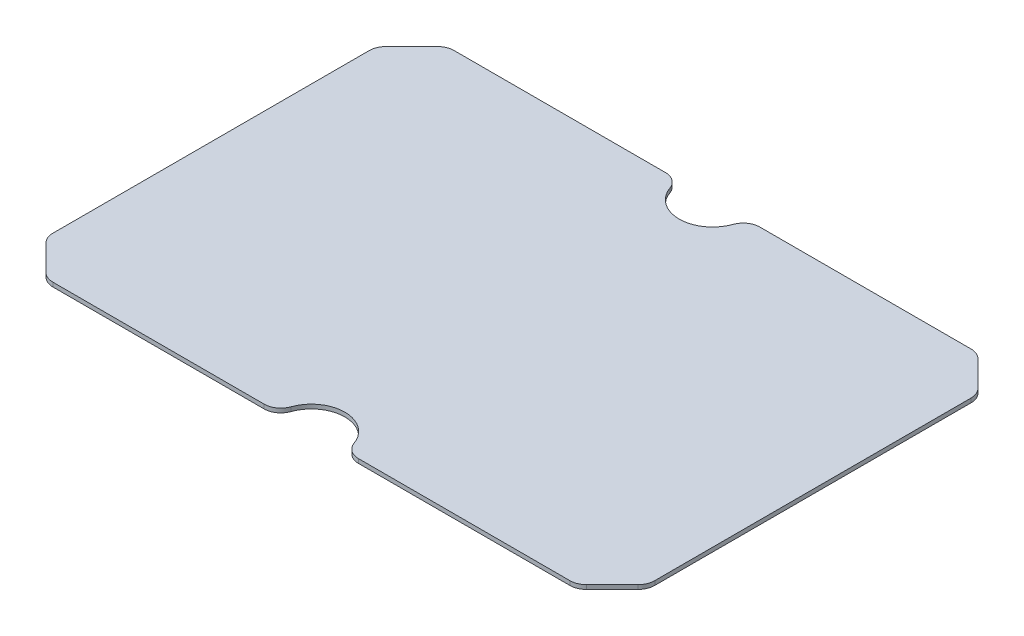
ISO-10303-21;
HEADER;
FILE_DESCRIPTION(('STEP AP214'),'2;1');
FILE_NAME('part.step','',(''),(''),'','','');
FILE_SCHEMA(('AUTOMOTIVE_DESIGN { 1 0 10303 214 1 1 1 1 }'));
ENDSEC;
DATA;
#1=APPLICATION_CONTEXT('core data for automotive mechanical design processes');
#2=APPLICATION_PROTOCOL_DEFINITION('international standard','automotive_design',2000,#1);
#3=PRODUCT_CONTEXT('',#1,'mechanical');
#4=PRODUCT('Part','Part','',(#3));
#5=PRODUCT_RELATED_PRODUCT_CATEGORY('part','',(#4));
#6=PRODUCT_DEFINITION_FORMATION('','',#4);
#7=PRODUCT_DEFINITION_CONTEXT('part definition',#1,'design');
#8=PRODUCT_DEFINITION('design','',#6,#7);
#9=PRODUCT_DEFINITION_SHAPE('','',#8);
#10=(LENGTH_UNIT() NAMED_UNIT(*) SI_UNIT(.MILLI.,.METRE.));
#11=(NAMED_UNIT(*) PLANE_ANGLE_UNIT() SI_UNIT($,.RADIAN.));
#12=(NAMED_UNIT(*) SI_UNIT($,.STERADIAN.) SOLID_ANGLE_UNIT());
#13=UNCERTAINTY_MEASURE_WITH_UNIT(LENGTH_MEASURE(1.E-05),#10,'distance_accuracy_value','');
#14=(GEOMETRIC_REPRESENTATION_CONTEXT(3) GLOBAL_UNCERTAINTY_ASSIGNED_CONTEXT((#13)) GLOBAL_UNIT_ASSIGNED_CONTEXT((#10,
#11,#12)) REPRESENTATION_CONTEXT('',''));
#15=CARTESIAN_POINT('',(0.,0.,0.));
#16=DIRECTION('',(0.,0.,1.));
#17=DIRECTION('',(1.,0.,0.));
#18=AXIS2_PLACEMENT_3D('',#15,#16,#17);
#19=CARTESIAN_POINT('',(-457.2,6.35,-304.8));
#20=DIRECTION('',(0.,0.,1.));
#21=DIRECTION('',(1.,0.,0.));
#22=AXIS2_PLACEMENT_3D('',#19,#20,#21);
#23=PLANE('',#22);
#24=DIRECTION('',(-1.,0.,0.));
#25=VECTOR('',#24,1.);
#26=CARTESIAN_POINT('',(-457.2,0.,-304.8));
#27=LINE('',#26,#25);
#28=CARTESIAN_POINT('',(392.703975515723,0.,-304.8));
#29=VERTEX_POINT('',#28);
#30=CARTESIAN_POINT('',(71.8420489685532,0.,-304.8));
#31=VERTEX_POINT('',#30);
#32=EDGE_CURVE('E248',#29,#31,#27,.T.);
#33=ORIENTED_EDGE('',*,*,#32,.T.);
#34=DIRECTION('',(0.,-1.,0.));
#35=VECTOR('',#34,1.);
#36=CARTESIAN_POINT('',(71.8420489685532,6.35,-304.8));
#37=LINE('',#36,#35);
#38=CARTESIAN_POINT('',(71.8420489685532,6.35,-304.8));
#39=VERTEX_POINT('',#38);
#40=EDGE_CURVE('E198',#31,#39,#37,.F.);
#41=ORIENTED_EDGE('',*,*,#40,.T.);
#42=DIRECTION('',(-1.,0.,0.));
#43=VECTOR('',#42,1.);
#44=CARTESIAN_POINT('',(-457.2,6.35,-304.8));
#45=LINE('',#44,#43);
#46=CARTESIAN_POINT('',(392.703975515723,6.35,-304.8));
#47=VERTEX_POINT('',#46);
#48=EDGE_CURVE('E237',#47,#39,#45,.T.);
#49=ORIENTED_EDGE('',*,*,#48,.F.);
#50=DIRECTION('',(0.,1.,0.));
#51=VECTOR('',#50,1.);
#52=CARTESIAN_POINT('',(392.703975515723,0.,-304.8));
#53=LINE('',#52,#51);
#54=EDGE_CURVE('E203',#47,#29,#53,.F.);
#55=ORIENTED_EDGE('',*,*,#54,.T.);
#56=EDGE_LOOP('',(#33,#41,#49,#55));
#57=FACE_BOUND('',#56,.T.);
#58=ADVANCED_FACE('F32',(#57),#23,.F.);
#59=CARTESIAN_POINT('',(-71.8420489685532,6.35,-304.8));
#60=VERTEX_POINT('',#59);
#61=CARTESIAN_POINT('',(-392.703975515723,6.35,-304.8));
#62=VERTEX_POINT('',#61);
#63=EDGE_CURVE('E233',#60,#62,#45,.T.);
#64=ORIENTED_EDGE('',*,*,#63,.F.);
#65=DIRECTION('',(0.,-1.,0.));
#66=VECTOR('',#65,1.);
#67=CARTESIAN_POINT('',(-71.8420489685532,0.,-304.8));
#68=LINE('',#67,#66);
#69=CARTESIAN_POINT('',(-71.8420489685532,0.,-304.8));
#70=VERTEX_POINT('',#69);
#71=EDGE_CURVE('E329',#60,#70,#68,.T.);
#72=ORIENTED_EDGE('',*,*,#71,.T.);
#73=CARTESIAN_POINT('',(-392.703975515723,0.,-304.8));
#74=VERTEX_POINT('',#73);
#75=EDGE_CURVE('E247',#70,#74,#27,.T.);
#76=ORIENTED_EDGE('',*,*,#75,.T.);
#77=DIRECTION('',(0.,-1.,0.));
#78=VECTOR('',#77,1.);
#79=CARTESIAN_POINT('',(-392.703975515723,6.35,-304.8));
#80=LINE('',#79,#78);
#81=EDGE_CURVE('E326',#74,#62,#80,.F.);
#82=ORIENTED_EDGE('',*,*,#81,.T.);
#83=EDGE_LOOP('',(#64,#72,#76,#82));
#84=FACE_BOUND('',#83,.T.);
#85=ADVANCED_FACE('F453',(#84),#23,.F.);
#86=CARTESIAN_POINT('',(457.2,6.35,-304.8));
#87=DIRECTION('',(0.,-1.,0.));
#88=DIRECTION('',(0.,0.,-1.));
#89=AXIS2_PLACEMENT_3D('',#86,#87,#88);
#90=PLANE('',#89);
#91=ORIENTED_EDGE('',*,*,#48,.T.);
#92=CARTESIAN_POINT('',(71.8420489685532,6.35,-279.4));
#93=DIRECTION('',(0.,-1.,0.));
#94=DIRECTION('',(0.,0.,-1.));
#95=AXIS2_PLACEMENT_3D('',#92,#93,#94);
#96=CIRCLE('',#95,25.4);
#97=CARTESIAN_POINT('',(47.8946993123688,6.35,-287.866666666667));
#98=VERTEX_POINT('',#97);
#99=EDGE_CURVE('E324',#39,#98,#96,.F.);
#100=ORIENTED_EDGE('',*,*,#99,.T.);
#101=CARTESIAN_POINT('',(0.,6.35,-304.8));
#102=DIRECTION('',(0.,-1.,0.));
#103=DIRECTION('',(0.,0.,-1.));
#104=AXIS2_PLACEMENT_3D('',#101,#102,#103);
#105=CIRCLE('',#104,50.8);
#106=CARTESIAN_POINT('',(-47.8946993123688,6.35,-287.866666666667));
#107=VERTEX_POINT('',#106);
#108=EDGE_CURVE('E214',#98,#107,#105,.T.);
#109=ORIENTED_EDGE('',*,*,#108,.T.);
#110=CARTESIAN_POINT('',(-71.8420489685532,6.35,-279.4));
#111=DIRECTION('',(0.,-1.,0.));
#112=DIRECTION('',(0.,0.,-1.));
#113=AXIS2_PLACEMENT_3D('',#110,#111,#112);
#114=CIRCLE('',#113,25.4);
#115=EDGE_CURVE('E322',#107,#60,#114,.F.);
#116=ORIENTED_EDGE('',*,*,#115,.T.);
#117=ORIENTED_EDGE('',*,*,#63,.T.);
#118=CARTESIAN_POINT('',(-392.703975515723,6.35,-279.4));
#119=DIRECTION('',(0.,-1.,0.));
#120=DIRECTION('',(0.,0.,-1.));
#121=AXIS2_PLACEMENT_3D('',#118,#119,#120);
#122=CIRCLE('',#121,25.4);
#123=CARTESIAN_POINT('',(-410.664487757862,6.35,-297.360512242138));
#124=VERTEX_POINT('',#123);
#125=EDGE_CURVE('E305',#62,#124,#122,.F.);
#126=ORIENTED_EDGE('',*,*,#125,.T.);
#127=DIRECTION('',(0.707106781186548,0.,-0.707106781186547));
#128=VECTOR('',#127,1.);
#129=CARTESIAN_POINT('',(-457.2,6.35,-250.825));
#130=LINE('',#129,#128);
#131=CARTESIAN_POINT('',(-449.760512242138,6.35,-258.264487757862));
#132=VERTEX_POINT('',#131);
#133=EDGE_CURVE('E270',#124,#132,#130,.F.);
#134=ORIENTED_EDGE('',*,*,#133,.T.);
#135=CARTESIAN_POINT('',(-431.8,6.35,-240.303975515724));
#136=DIRECTION('',(0.,-1.,0.));
#137=DIRECTION('',(0.,0.,-1.));
#138=AXIS2_PLACEMENT_3D('',#135,#136,#137);
#139=CIRCLE('',#138,25.4);
#140=CARTESIAN_POINT('',(-457.2,6.35,-240.303975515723));
#141=VERTEX_POINT('',#140);
#142=EDGE_CURVE('E303',#132,#141,#139,.F.);
#143=ORIENTED_EDGE('',*,*,#142,.T.);
#144=DIRECTION('',(0.,0.,1.));
#145=VECTOR('',#144,1.);
#146=CARTESIAN_POINT('',(-457.2,6.35,304.8));
#147=LINE('',#146,#145);
#148=CARTESIAN_POINT('',(-457.2,6.35,240.303975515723));
#149=VERTEX_POINT('',#148);
#150=EDGE_CURVE('E238',#141,#149,#147,.T.);
#151=ORIENTED_EDGE('',*,*,#150,.T.);
#152=CARTESIAN_POINT('',(-431.8,6.35,240.303975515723));
#153=DIRECTION('',(0.,-1.,0.));
#154=DIRECTION('',(0.,0.,-1.));
#155=AXIS2_PLACEMENT_3D('',#152,#153,#154);
#156=CIRCLE('',#155,25.4);
#157=CARTESIAN_POINT('',(-449.760512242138,6.35,258.264487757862));
#158=VERTEX_POINT('',#157);
#159=EDGE_CURVE('E307',#149,#158,#156,.F.);
#160=ORIENTED_EDGE('',*,*,#159,.T.);
#161=DIRECTION('',(-0.707106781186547,0.,-0.707106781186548));
#162=VECTOR('',#161,1.);
#163=CARTESIAN_POINT('',(-403.225,6.35,304.8));
#164=LINE('',#163,#162);
#165=CARTESIAN_POINT('',(-410.664487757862,6.35,297.360512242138));
#166=VERTEX_POINT('',#165);
#167=EDGE_CURVE('E267',#158,#166,#164,.F.);
#168=ORIENTED_EDGE('',*,*,#167,.T.);
#169=CARTESIAN_POINT('',(-392.703975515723,6.35,279.4));
#170=DIRECTION('',(0.,-1.,0.));
#171=DIRECTION('',(0.,0.,-1.));
#172=AXIS2_PLACEMENT_3D('',#169,#170,#171);
#173=CIRCLE('',#172,25.4);
#174=CARTESIAN_POINT('',(-392.703975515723,6.35,304.8));
#175=VERTEX_POINT('',#174);
#176=EDGE_CURVE('E309',#166,#175,#173,.F.);
#177=ORIENTED_EDGE('',*,*,#176,.T.);
#178=DIRECTION('',(1.,0.,0.));
#179=VECTOR('',#178,1.);
#180=CARTESIAN_POINT('',(-457.2,6.35,304.8));
#181=LINE('',#180,#179);
#182=CARTESIAN_POINT('',(-71.8420489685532,6.35,304.8));
#183=VERTEX_POINT('',#182);
#184=EDGE_CURVE('E242',#175,#183,#181,.T.);
#185=ORIENTED_EDGE('',*,*,#184,.T.);
#186=CARTESIAN_POINT('',(-71.8420489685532,6.35,279.4));
#187=DIRECTION('',(0.,-1.,0.));
#188=DIRECTION('',(0.,0.,-1.));
#189=AXIS2_PLACEMENT_3D('',#186,#187,#188);
#190=CIRCLE('',#189,25.4);
#191=CARTESIAN_POINT('',(-47.8946993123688,6.35,287.866666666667));
#192=VERTEX_POINT('',#191);
#193=EDGE_CURVE('E47',#183,#192,#190,.F.);
#194=ORIENTED_EDGE('',*,*,#193,.T.);
#195=CARTESIAN_POINT('',(0.,6.35,304.8));
#196=DIRECTION('',(0.,1.,0.));
#197=DIRECTION('',(0.,0.,1.));
#198=AXIS2_PLACEMENT_3D('',#195,#196,#197);
#199=CIRCLE('',#198,50.8);
#200=CARTESIAN_POINT('',(47.8946993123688,6.35,287.866666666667));
#201=VERTEX_POINT('',#200);
#202=EDGE_CURVE('E221',#201,#192,#199,.T.);
#203=ORIENTED_EDGE('',*,*,#202,.F.);
#204=CARTESIAN_POINT('',(71.8420489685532,6.35,279.4));
#205=DIRECTION('',(0.,-1.,0.));
#206=DIRECTION('',(0.,0.,-1.));
#207=AXIS2_PLACEMENT_3D('',#204,#205,#206);
#208=CIRCLE('',#207,25.4);
#209=CARTESIAN_POINT('',(71.8420489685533,6.35,304.8));
#210=VERTEX_POINT('',#209);
#211=EDGE_CURVE('E312',#201,#210,#208,.F.);
#212=ORIENTED_EDGE('',*,*,#211,.T.);
#213=CARTESIAN_POINT('',(392.703975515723,6.35,304.8));
#214=VERTEX_POINT('',#213);
#215=EDGE_CURVE('E241',#210,#214,#181,.T.);
#216=ORIENTED_EDGE('',*,*,#215,.T.);
#217=CARTESIAN_POINT('',(392.703975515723,6.35,279.4));
#218=DIRECTION('',(0.,-1.,0.));
#219=DIRECTION('',(0.,0.,-1.));
#220=AXIS2_PLACEMENT_3D('',#217,#218,#219);
#221=CIRCLE('',#220,25.4);
#222=CARTESIAN_POINT('',(410.664487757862,6.35,297.360512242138));
#223=VERTEX_POINT('',#222);
#224=EDGE_CURVE('E314',#214,#223,#221,.F.);
#225=ORIENTED_EDGE('',*,*,#224,.T.);
#226=DIRECTION('',(-0.707106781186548,0.,0.707106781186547));
#227=VECTOR('',#226,1.);
#228=CARTESIAN_POINT('',(457.2,6.35,250.825));
#229=LINE('',#228,#227);
#230=CARTESIAN_POINT('',(449.760512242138,6.35,258.264487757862));
#231=VERTEX_POINT('',#230);
#232=EDGE_CURVE('E276',#223,#231,#229,.F.);
#233=ORIENTED_EDGE('',*,*,#232,.T.);
#234=CARTESIAN_POINT('',(431.8,6.35,240.303975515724));
#235=DIRECTION('',(0.,-1.,0.));
#236=DIRECTION('',(0.,0.,-1.));
#237=AXIS2_PLACEMENT_3D('',#234,#235,#236);
#238=CIRCLE('',#237,25.4);
#239=CARTESIAN_POINT('',(457.2,6.35,240.303975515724));
#240=VERTEX_POINT('',#239);
#241=EDGE_CURVE('E316',#231,#240,#238,.F.);
#242=ORIENTED_EDGE('',*,*,#241,.T.);
#243=DIRECTION('',(0.,0.,-1.));
#244=VECTOR('',#243,1.);
#245=CARTESIAN_POINT('',(457.2,6.35,304.8));
#246=LINE('',#245,#244);
#247=CARTESIAN_POINT('',(457.2,6.35,-240.303975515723));
#248=VERTEX_POINT('',#247);
#249=EDGE_CURVE('E230',#240,#248,#246,.T.);
#250=ORIENTED_EDGE('',*,*,#249,.T.);
#251=CARTESIAN_POINT('',(431.8,6.35,-240.303975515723));
#252=DIRECTION('',(0.,-1.,0.));
#253=DIRECTION('',(0.,0.,-1.));
#254=AXIS2_PLACEMENT_3D('',#251,#252,#253);
#255=CIRCLE('',#254,25.4);
#256=CARTESIAN_POINT('',(449.760512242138,6.35,-258.264487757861));
#257=VERTEX_POINT('',#256);
#258=EDGE_CURVE('E318',#248,#257,#255,.F.);
#259=ORIENTED_EDGE('',*,*,#258,.T.);
#260=DIRECTION('',(0.707106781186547,0.,0.707106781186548));
#261=VECTOR('',#260,1.);
#262=CARTESIAN_POINT('',(403.225,6.35,-304.8));
#263=LINE('',#262,#261);
#264=CARTESIAN_POINT('',(410.664487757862,6.35,-297.360512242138));
#265=VERTEX_POINT('',#264);
#266=EDGE_CURVE('E273',#257,#265,#263,.F.);
#267=ORIENTED_EDGE('',*,*,#266,.T.);
#268=CARTESIAN_POINT('',(392.703975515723,6.35,-279.4));
#269=DIRECTION('',(0.,-1.,0.));
#270=DIRECTION('',(0.,0.,-1.));
#271=AXIS2_PLACEMENT_3D('',#268,#269,#270);
#272=CIRCLE('',#271,25.4);
#273=EDGE_CURVE('E320',#265,#47,#272,.F.);
#274=ORIENTED_EDGE('',*,*,#273,.T.);
#275=EDGE_LOOP('',(#91,#100,#109,#116,#117,#126,#134,#143,#151,#160,#168,#177,#185,#194,#203,
#212,#216,#225,#233,#242,#250,#259,#267,#274));
#276=FACE_BOUND('',#275,.T.);
#277=ADVANCED_FACE('F378',(#276),#90,.F.);
#278=CARTESIAN_POINT('',(457.2,0.,-304.8));
#279=DIRECTION('',(0.,-1.,0.));
#280=DIRECTION('',(0.,0.,-1.));
#281=AXIS2_PLACEMENT_3D('',#278,#279,#280);
#282=PLANE('',#281);
#283=CARTESIAN_POINT('',(0.,0.,-304.8));
#284=DIRECTION('',(0.,-1.,0.));
#285=DIRECTION('',(0.,0.,-1.));
#286=AXIS2_PLACEMENT_3D('',#283,#284,#285);
#287=CIRCLE('',#286,50.8);
#288=CARTESIAN_POINT('',(47.8946993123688,0.,-287.866666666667));
#289=VERTEX_POINT('',#288);
#290=CARTESIAN_POINT('',(-47.8946993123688,0.,-287.866666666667));
#291=VERTEX_POINT('',#290);
#292=EDGE_CURVE('E211',#289,#291,#287,.T.);
#293=ORIENTED_EDGE('',*,*,#292,.F.);
#294=CARTESIAN_POINT('',(71.8420489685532,0.,-279.4));
#295=DIRECTION('',(0.,-1.,0.));
#296=DIRECTION('',(0.,0.,-1.));
#297=AXIS2_PLACEMENT_3D('',#294,#295,#296);
#298=CIRCLE('',#297,25.4);
#299=EDGE_CURVE('E193',#289,#31,#298,.T.);
#300=ORIENTED_EDGE('',*,*,#299,.T.);
#301=ORIENTED_EDGE('',*,*,#32,.F.);
#302=CARTESIAN_POINT('',(392.703975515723,0.,-279.4));
#303=DIRECTION('',(0.,-1.,0.));
#304=DIRECTION('',(0.,0.,-1.));
#305=AXIS2_PLACEMENT_3D('',#302,#303,#304);
#306=CIRCLE('',#305,25.4);
#307=CARTESIAN_POINT('',(410.664487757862,0.,-297.360512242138));
#308=VERTEX_POINT('',#307);
#309=EDGE_CURVE('E297',#29,#308,#306,.T.);
#310=ORIENTED_EDGE('',*,*,#309,.T.);
#311=DIRECTION('',(-0.707106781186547,0.,-0.707106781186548));
#312=VECTOR('',#311,1.);
#313=CARTESIAN_POINT('',(430.2125,0.,-277.8125));
#314=LINE('',#313,#312);
#315=CARTESIAN_POINT('',(449.760512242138,0.,-258.264487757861));
#316=VERTEX_POINT('',#315);
#317=EDGE_CURVE('E261',#308,#316,#314,.F.);
#318=ORIENTED_EDGE('',*,*,#317,.T.);
#319=CARTESIAN_POINT('',(431.8,0.,-240.303975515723));
#320=DIRECTION('',(0.,-1.,0.));
#321=DIRECTION('',(0.,0.,-1.));
#322=AXIS2_PLACEMENT_3D('',#319,#320,#321);
#323=CIRCLE('',#322,25.4);
#324=CARTESIAN_POINT('',(457.2,0.,-240.303975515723));
#325=VERTEX_POINT('',#324);
#326=EDGE_CURVE('E295',#316,#325,#323,.T.);
#327=ORIENTED_EDGE('',*,*,#326,.T.);
#328=DIRECTION('',(0.,0.,-1.));
#329=VECTOR('',#328,1.);
#330=CARTESIAN_POINT('',(457.2,0.,304.8));
#331=LINE('',#330,#329);
#332=CARTESIAN_POINT('',(457.2,0.,240.303975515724));
#333=VERTEX_POINT('',#332);
#334=EDGE_CURVE('E228',#333,#325,#331,.T.);
#335=ORIENTED_EDGE('',*,*,#334,.F.);
#336=CARTESIAN_POINT('',(431.8,0.,240.303975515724));
#337=DIRECTION('',(0.,-1.,0.));
#338=DIRECTION('',(0.,0.,-1.));
#339=AXIS2_PLACEMENT_3D('',#336,#337,#338);
#340=CIRCLE('',#339,25.4);
#341=CARTESIAN_POINT('',(449.760512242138,0.,258.264487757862));
#342=VERTEX_POINT('',#341);
#343=EDGE_CURVE('E293',#333,#342,#340,.T.);
#344=ORIENTED_EDGE('',*,*,#343,.T.);
#345=DIRECTION('',(0.707106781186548,0.,-0.707106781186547));
#346=VECTOR('',#345,1.);
#347=CARTESIAN_POINT('',(735.0125,0.,-26.9874999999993));
#348=LINE('',#347,#346);
#349=CARTESIAN_POINT('',(410.664487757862,0.,297.360512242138));
#350=VERTEX_POINT('',#349);
#351=EDGE_CURVE('E264',#342,#350,#348,.F.);
#352=ORIENTED_EDGE('',*,*,#351,.T.);
#353=CARTESIAN_POINT('',(392.703975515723,0.,279.4));
#354=DIRECTION('',(0.,-1.,0.));
#355=DIRECTION('',(0.,0.,-1.));
#356=AXIS2_PLACEMENT_3D('',#353,#354,#355);
#357=CIRCLE('',#356,25.4);
#358=CARTESIAN_POINT('',(392.703975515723,0.,304.8));
#359=VERTEX_POINT('',#358);
#360=EDGE_CURVE('E291',#350,#359,#357,.T.);
#361=ORIENTED_EDGE('',*,*,#360,.T.);
#362=DIRECTION('',(1.,0.,0.));
#363=VECTOR('',#362,1.);
#364=CARTESIAN_POINT('',(-457.2,0.,304.8));
#365=LINE('',#364,#363);
#366=CARTESIAN_POINT('',(71.8420489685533,0.,304.8));
#367=VERTEX_POINT('',#366);
#368=EDGE_CURVE('E253',#367,#359,#365,.T.);
#369=ORIENTED_EDGE('',*,*,#368,.F.);
#370=CARTESIAN_POINT('',(71.8420489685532,0.,279.4));
#371=DIRECTION('',(0.,-1.,0.));
#372=DIRECTION('',(0.,0.,-1.));
#373=AXIS2_PLACEMENT_3D('',#370,#371,#372);
#374=CIRCLE('',#373,25.4);
#375=CARTESIAN_POINT('',(47.8946993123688,0.,287.866666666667));
#376=VERTEX_POINT('',#375);
#377=EDGE_CURVE('E289',#367,#376,#374,.T.);
#378=ORIENTED_EDGE('',*,*,#377,.T.);
#379=CARTESIAN_POINT('',(0.,0.,304.8));
#380=DIRECTION('',(0.,1.,0.));
#381=DIRECTION('',(0.,0.,1.));
#382=AXIS2_PLACEMENT_3D('',#379,#380,#381);
#383=CIRCLE('',#382,50.8);
#384=CARTESIAN_POINT('',(-47.8946993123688,0.,287.866666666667));
#385=VERTEX_POINT('',#384);
#386=EDGE_CURVE('E223',#376,#385,#383,.T.);
#387=ORIENTED_EDGE('',*,*,#386,.T.);
#388=CARTESIAN_POINT('',(-71.8420489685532,0.,279.4));
#389=DIRECTION('',(0.,-1.,0.));
#390=DIRECTION('',(0.,0.,-1.));
#391=AXIS2_PLACEMENT_3D('',#388,#389,#390);
#392=CIRCLE('',#391,25.4);
#393=CARTESIAN_POINT('',(-71.8420489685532,0.,304.8));
#394=VERTEX_POINT('',#393);
#395=EDGE_CURVE('E287',#385,#394,#392,.T.);
#396=ORIENTED_EDGE('',*,*,#395,.T.);
#397=CARTESIAN_POINT('',(-392.703975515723,0.,304.8));
#398=VERTEX_POINT('',#397);
#399=EDGE_CURVE('E234',#398,#394,#365,.T.);
#400=ORIENTED_EDGE('',*,*,#399,.F.);
#401=CARTESIAN_POINT('',(-392.703975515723,0.,279.4));
#402=DIRECTION('',(0.,-1.,0.));
#403=DIRECTION('',(0.,0.,-1.));
#404=AXIS2_PLACEMENT_3D('',#401,#402,#403);
#405=CIRCLE('',#404,25.4);
#406=CARTESIAN_POINT('',(-410.664487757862,0.,297.360512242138));
#407=VERTEX_POINT('',#406);
#408=EDGE_CURVE('E285',#398,#407,#405,.T.);
#409=ORIENTED_EDGE('',*,*,#408,.T.);
#410=DIRECTION('',(0.707106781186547,0.,0.707106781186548));
#411=VECTOR('',#410,1.);
#412=CARTESIAN_POINT('',(-277.812500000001,0.,430.212499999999));
#413=LINE('',#412,#411);
#414=CARTESIAN_POINT('',(-449.760512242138,0.,258.264487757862));
#415=VERTEX_POINT('',#414);
#416=EDGE_CURVE('E244',#407,#415,#413,.F.);
#417=ORIENTED_EDGE('',*,*,#416,.T.);
#418=CARTESIAN_POINT('',(-431.8,0.,240.303975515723));
#419=DIRECTION('',(0.,-1.,0.));
#420=DIRECTION('',(0.,0.,-1.));
#421=AXIS2_PLACEMENT_3D('',#418,#419,#420);
#422=CIRCLE('',#421,25.4);
#423=CARTESIAN_POINT('',(-457.2,0.,240.303975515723));
#424=VERTEX_POINT('',#423);
#425=EDGE_CURVE('E283',#415,#424,#422,.T.);
#426=ORIENTED_EDGE('',*,*,#425,.T.);
#427=DIRECTION('',(0.,0.,1.));
#428=VECTOR('',#427,1.);
#429=CARTESIAN_POINT('',(-457.2,0.,304.8));
#430=LINE('',#429,#428);
#431=CARTESIAN_POINT('',(-457.2,0.,-240.303975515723));
#432=VERTEX_POINT('',#431);
#433=EDGE_CURVE('E250',#432,#424,#430,.T.);
#434=ORIENTED_EDGE('',*,*,#433,.F.);
#435=CARTESIAN_POINT('',(-431.8,0.,-240.303975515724));
#436=DIRECTION('',(0.,-1.,0.));
#437=DIRECTION('',(0.,0.,-1.));
#438=AXIS2_PLACEMENT_3D('',#435,#436,#437);
#439=CIRCLE('',#438,25.4);
#440=CARTESIAN_POINT('',(-449.760512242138,0.,-258.264487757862));
#441=VERTEX_POINT('',#440);
#442=EDGE_CURVE('E215',#432,#441,#439,.T.);
#443=ORIENTED_EDGE('',*,*,#442,.T.);
#444=DIRECTION('',(-0.707106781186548,0.,0.707106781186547));
#445=VECTOR('',#444,1.);
#446=CARTESIAN_POINT('',(26.9875000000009,0.,-735.0125));
#447=LINE('',#446,#445);
#448=CARTESIAN_POINT('',(-410.664487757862,0.,-297.360512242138));
#449=VERTEX_POINT('',#448);
#450=EDGE_CURVE('E258',#441,#449,#447,.F.);
#451=ORIENTED_EDGE('',*,*,#450,.T.);
#452=CARTESIAN_POINT('',(-392.703975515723,0.,-279.4));
#453=DIRECTION('',(0.,-1.,0.));
#454=DIRECTION('',(0.,0.,-1.));
#455=AXIS2_PLACEMENT_3D('',#452,#453,#454);
#456=CIRCLE('',#455,25.4);
#457=EDGE_CURVE('E281',#449,#74,#456,.T.);
#458=ORIENTED_EDGE('',*,*,#457,.T.);
#459=ORIENTED_EDGE('',*,*,#75,.F.);
#460=CARTESIAN_POINT('',(-71.8420489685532,0.,-279.4));
#461=DIRECTION('',(0.,-1.,0.));
#462=DIRECTION('',(0.,0.,-1.));
#463=AXIS2_PLACEMENT_3D('',#460,#461,#462);
#464=CIRCLE('',#463,25.4);
#465=EDGE_CURVE('E204',#70,#291,#464,.T.);
#466=ORIENTED_EDGE('',*,*,#465,.T.);
#467=EDGE_LOOP('',(#293,#300,#301,#310,#318,#327,#335,#344,#352,#361,#369,#378,#387,#396,#400,
#409,#417,#426,#434,#443,#451,#458,#459,#466));
#468=FACE_BOUND('',#467,.T.);
#469=ADVANCED_FACE('F218',(#468),#282,.T.);
#470=CARTESIAN_POINT('',(-457.2,6.35,304.8));
#471=DIRECTION('',(0.,0.,-1.));
#472=DIRECTION('',(-1.,0.,0.));
#473=AXIS2_PLACEMENT_3D('',#470,#471,#472);
#474=PLANE('',#473);
#475=ORIENTED_EDGE('',*,*,#399,.T.);
#476=DIRECTION('',(0.,1.,0.));
#477=VECTOR('',#476,1.);
#478=CARTESIAN_POINT('',(-71.8420489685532,6.35,304.8));
#479=LINE('',#478,#477);
#480=EDGE_CURVE('E357',#394,#183,#479,.T.);
#481=ORIENTED_EDGE('',*,*,#480,.T.);
#482=ORIENTED_EDGE('',*,*,#184,.F.);
#483=DIRECTION('',(0.,1.,0.));
#484=VECTOR('',#483,1.);
#485=CARTESIAN_POINT('',(-392.703975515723,0.,304.8));
#486=LINE('',#485,#484);
#487=EDGE_CURVE('E354',#175,#398,#486,.F.);
#488=ORIENTED_EDGE('',*,*,#487,.T.);
#489=EDGE_LOOP('',(#475,#481,#482,#488));
#490=FACE_BOUND('',#489,.T.);
#491=ADVANCED_FACE('F400',(#490),#474,.F.);
#492=CARTESIAN_POINT('',(457.2,6.35,304.8));
#493=DIRECTION('',(-1.,0.,0.));
#494=DIRECTION('',(0.,0.,1.));
#495=AXIS2_PLACEMENT_3D('',#492,#493,#494);
#496=PLANE('',#495);
#497=ORIENTED_EDGE('',*,*,#334,.T.);
#498=DIRECTION('',(0.,-1.,0.));
#499=VECTOR('',#498,1.);
#500=CARTESIAN_POINT('',(457.2,6.35,-240.303975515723));
#501=LINE('',#500,#499);
#502=EDGE_CURVE('E338',#325,#248,#501,.F.);
#503=ORIENTED_EDGE('',*,*,#502,.T.);
#504=ORIENTED_EDGE('',*,*,#249,.F.);
#505=DIRECTION('',(0.,1.,0.));
#506=VECTOR('',#505,1.);
#507=CARTESIAN_POINT('',(457.2,0.,240.303975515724));
#508=LINE('',#507,#506);
#509=EDGE_CURVE('E335',#240,#333,#508,.F.);
#510=ORIENTED_EDGE('',*,*,#509,.T.);
#511=EDGE_LOOP('',(#497,#503,#504,#510));
#512=FACE_BOUND('',#511,.T.);
#513=ADVANCED_FACE('F435',(#512),#496,.F.);
#514=CARTESIAN_POINT('',(-457.2,6.35,304.8));
#515=DIRECTION('',(1.,0.,0.));
#516=DIRECTION('',(0.,0.,-1.));
#517=AXIS2_PLACEMENT_3D('',#514,#515,#516);
#518=PLANE('',#517);
#519=ORIENTED_EDGE('',*,*,#433,.T.);
#520=DIRECTION('',(0.,-1.,0.));
#521=VECTOR('',#520,1.);
#522=CARTESIAN_POINT('',(-457.2,6.35,240.303975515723));
#523=LINE('',#522,#521);
#524=EDGE_CURVE('E367',#424,#149,#523,.F.);
#525=ORIENTED_EDGE('',*,*,#524,.T.);
#526=ORIENTED_EDGE('',*,*,#150,.F.);
#527=DIRECTION('',(0.,1.,0.));
#528=VECTOR('',#527,1.);
#529=CARTESIAN_POINT('',(-457.2,0.,-240.303975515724));
#530=LINE('',#529,#528);
#531=EDGE_CURVE('E364',#141,#432,#530,.F.);
#532=ORIENTED_EDGE('',*,*,#531,.T.);
#533=EDGE_LOOP('',(#519,#525,#526,#532));
#534=FACE_BOUND('',#533,.T.);
#535=ADVANCED_FACE('F383',(#534),#518,.F.);
#536=ORIENTED_EDGE('',*,*,#368,.T.);
#537=DIRECTION('',(0.,-1.,0.));
#538=VECTOR('',#537,1.);
#539=CARTESIAN_POINT('',(392.703975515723,6.35,304.8));
#540=LINE('',#539,#538);
#541=EDGE_CURVE('E348',#359,#214,#540,.F.);
#542=ORIENTED_EDGE('',*,*,#541,.T.);
#543=ORIENTED_EDGE('',*,*,#215,.F.);
#544=DIRECTION('',(0.,1.,0.));
#545=VECTOR('',#544,1.);
#546=CARTESIAN_POINT('',(71.8420489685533,6.35,304.8));
#547=LINE('',#546,#545);
#548=EDGE_CURVE('E345',#210,#367,#547,.F.);
#549=ORIENTED_EDGE('',*,*,#548,.T.);
#550=EDGE_LOOP('',(#536,#542,#543,#549));
#551=FACE_BOUND('',#550,.T.);
#552=ADVANCED_FACE('F416',(#551),#474,.F.);
#553=CARTESIAN_POINT('',(0.,0.,304.8));
#554=DIRECTION('',(0.,1.,0.));
#555=DIRECTION('',(0.,0.,1.));
#556=AXIS2_PLACEMENT_3D('',#553,#554,#555);
#557=CYLINDRICAL_SURFACE('',#556,50.8);
#558=ORIENTED_EDGE('',*,*,#386,.F.);
#559=DIRECTION('',(0.,1.,0.));
#560=VECTOR('',#559,1.);
#561=CARTESIAN_POINT('',(47.8946993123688,0.,287.866666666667));
#562=LINE('',#561,#560);
#563=EDGE_CURVE('E54',#376,#201,#562,.T.);
#564=ORIENTED_EDGE('',*,*,#563,.T.);
#565=ORIENTED_EDGE('',*,*,#202,.T.);
#566=DIRECTION('',(0.,1.,0.));
#567=VECTOR('',#566,1.);
#568=CARTESIAN_POINT('',(-47.8946993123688,0.,287.866666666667));
#569=LINE('',#568,#567);
#570=EDGE_CURVE('E351',#192,#385,#569,.F.);
#571=ORIENTED_EDGE('',*,*,#570,.T.);
#572=EDGE_LOOP('',(#558,#564,#565,#571));
#573=FACE_BOUND('',#572,.T.);
#574=ADVANCED_FACE('F407',(#573),#557,.F.);
#575=CARTESIAN_POINT('',(0.,0.,-304.8));
#576=DIRECTION('',(0.,1.,0.));
#577=DIRECTION('',(0.,0.,1.));
#578=AXIS2_PLACEMENT_3D('',#575,#576,#577);
#579=CYLINDRICAL_SURFACE('',#578,50.8);
#580=ORIENTED_EDGE('',*,*,#108,.F.);
#581=DIRECTION('',(0.,1.,0.));
#582=VECTOR('',#581,1.);
#583=CARTESIAN_POINT('',(47.8946993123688,0.,-287.866666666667));
#584=LINE('',#583,#582);
#585=EDGE_CURVE('E197',#98,#289,#584,.F.);
#586=ORIENTED_EDGE('',*,*,#585,.T.);
#587=ORIENTED_EDGE('',*,*,#292,.T.);
#588=DIRECTION('',(0.,1.,0.));
#589=VECTOR('',#588,1.);
#590=CARTESIAN_POINT('',(-47.8946993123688,0.,-287.866666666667));
#591=LINE('',#590,#589);
#592=EDGE_CURVE('E216',#291,#107,#591,.T.);
#593=ORIENTED_EDGE('',*,*,#592,.T.);
#594=EDGE_LOOP('',(#580,#586,#587,#593));
#595=FACE_BOUND('',#594,.T.);
#596=ADVANCED_FACE('F209',(#595),#579,.F.);
#597=CARTESIAN_POINT('',(457.2,6.35,250.825));
#598=DIRECTION('',(-0.707106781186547,0.,-0.707106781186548));
#599=DIRECTION('',(-0.707106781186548,0.,0.707106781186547));
#600=AXIS2_PLACEMENT_3D('',#597,#598,#599);
#601=PLANE('',#600);
#602=ORIENTED_EDGE('',*,*,#351,.F.);
#603=DIRECTION('',(0.,-1.,0.));
#604=VECTOR('',#603,1.);
#605=CARTESIAN_POINT('',(449.760512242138,6.35,258.264487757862));
#606=LINE('',#605,#604);
#607=EDGE_CURVE('E343',#342,#231,#606,.F.);
#608=ORIENTED_EDGE('',*,*,#607,.T.);
#609=ORIENTED_EDGE('',*,*,#232,.F.);
#610=DIRECTION('',(0.,1.,0.));
#611=VECTOR('',#610,1.);
#612=CARTESIAN_POINT('',(410.664487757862,0.,297.360512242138));
#613=LINE('',#612,#611);
#614=EDGE_CURVE('E341',#223,#350,#613,.F.);
#615=ORIENTED_EDGE('',*,*,#614,.T.);
#616=EDGE_LOOP('',(#602,#608,#609,#615));
#617=FACE_BOUND('',#616,.T.);
#618=ADVANCED_FACE('F425',(#617),#601,.F.);
#619=CARTESIAN_POINT('',(403.225,6.35,-304.8));
#620=DIRECTION('',(-0.707106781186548,0.,0.707106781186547));
#621=DIRECTION('',(0.707106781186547,0.,0.707106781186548));
#622=AXIS2_PLACEMENT_3D('',#619,#620,#621);
#623=PLANE('',#622);
#624=ORIENTED_EDGE('',*,*,#317,.F.);
#625=DIRECTION('',(0.,-1.,0.));
#626=VECTOR('',#625,1.);
#627=CARTESIAN_POINT('',(410.664487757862,6.35,-297.360512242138));
#628=LINE('',#627,#626);
#629=EDGE_CURVE('E333',#308,#265,#628,.F.);
#630=ORIENTED_EDGE('',*,*,#629,.T.);
#631=ORIENTED_EDGE('',*,*,#266,.F.);
#632=DIRECTION('',(0.,1.,0.));
#633=VECTOR('',#632,1.);
#634=CARTESIAN_POINT('',(449.760512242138,0.,-258.264487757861));
#635=LINE('',#634,#633);
#636=EDGE_CURVE('E331',#257,#316,#635,.F.);
#637=ORIENTED_EDGE('',*,*,#636,.T.);
#638=EDGE_LOOP('',(#624,#630,#631,#637));
#639=FACE_BOUND('',#638,.T.);
#640=ADVANCED_FACE('F445',(#639),#623,.F.);
#641=CARTESIAN_POINT('',(-457.2,6.35,-250.825));
#642=DIRECTION('',(0.707106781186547,0.,0.707106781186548));
#643=DIRECTION('',(0.707106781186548,0.,-0.707106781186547));
#644=AXIS2_PLACEMENT_3D('',#641,#642,#643);
#645=PLANE('',#644);
#646=ORIENTED_EDGE('',*,*,#133,.F.);
#647=DIRECTION('',(0.,1.,0.));
#648=VECTOR('',#647,1.);
#649=CARTESIAN_POINT('',(-410.664487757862,0.,-297.360512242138));
#650=LINE('',#649,#648);
#651=EDGE_CURVE('E11',#124,#449,#650,.F.);
#652=ORIENTED_EDGE('',*,*,#651,.T.);
#653=ORIENTED_EDGE('',*,*,#450,.F.);
#654=DIRECTION('',(0.,-1.,0.));
#655=VECTOR('',#654,1.);
#656=CARTESIAN_POINT('',(-449.760512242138,6.35,-258.264487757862));
#657=LINE('',#656,#655);
#658=EDGE_CURVE('E40',#441,#132,#657,.F.);
#659=ORIENTED_EDGE('',*,*,#658,.T.);
#660=EDGE_LOOP('',(#646,#652,#653,#659));
#661=FACE_BOUND('',#660,.T.);
#662=ADVANCED_FACE('F373',(#661),#645,.F.);
#663=CARTESIAN_POINT('',(-403.225,6.35,304.8));
#664=DIRECTION('',(0.707106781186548,0.,-0.707106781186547));
#665=DIRECTION('',(-0.707106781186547,0.,-0.707106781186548));
#666=AXIS2_PLACEMENT_3D('',#663,#664,#665);
#667=PLANE('',#666);
#668=ORIENTED_EDGE('',*,*,#416,.F.);
#669=DIRECTION('',(0.,-1.,0.));
#670=VECTOR('',#669,1.);
#671=CARTESIAN_POINT('',(-410.664487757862,6.35,297.360512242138));
#672=LINE('',#671,#670);
#673=EDGE_CURVE('E362',#407,#166,#672,.F.);
#674=ORIENTED_EDGE('',*,*,#673,.T.);
#675=ORIENTED_EDGE('',*,*,#167,.F.);
#676=DIRECTION('',(0.,1.,0.));
#677=VECTOR('',#676,1.);
#678=CARTESIAN_POINT('',(-449.760512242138,0.,258.264487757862));
#679=LINE('',#678,#677);
#680=EDGE_CURVE('E360',#158,#415,#679,.F.);
#681=ORIENTED_EDGE('',*,*,#680,.T.);
#682=EDGE_LOOP('',(#668,#674,#675,#681));
#683=FACE_BOUND('',#682,.T.);
#684=ADVANCED_FACE('F393',(#683),#667,.F.);
#685=CARTESIAN_POINT('',(71.8420489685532,0.,-279.4));
#686=DIRECTION('',(0.,1.,0.));
#687=DIRECTION('',(0.,0.,1.));
#688=AXIS2_PLACEMENT_3D('',#685,#686,#687);
#689=CYLINDRICAL_SURFACE('',#688,25.4);
#690=ORIENTED_EDGE('',*,*,#99,.F.);
#691=ORIENTED_EDGE('',*,*,#40,.F.);
#692=ORIENTED_EDGE('',*,*,#299,.F.);
#693=ORIENTED_EDGE('',*,*,#585,.F.);
#694=EDGE_LOOP('',(#690,#691,#692,#693));
#695=FACE_BOUND('',#694,.T.);
#696=ADVANCED_FACE('F196',(#695),#689,.T.);
#697=CARTESIAN_POINT('',(-71.8420489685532,0.,-279.4));
#698=DIRECTION('',(0.,1.,0.));
#699=DIRECTION('',(0.,0.,1.));
#700=AXIS2_PLACEMENT_3D('',#697,#698,#699);
#701=CYLINDRICAL_SURFACE('',#700,25.4);
#702=ORIENTED_EDGE('',*,*,#465,.F.);
#703=ORIENTED_EDGE('',*,*,#71,.F.);
#704=ORIENTED_EDGE('',*,*,#115,.F.);
#705=ORIENTED_EDGE('',*,*,#592,.F.);
#706=EDGE_LOOP('',(#702,#703,#704,#705));
#707=FACE_BOUND('',#706,.T.);
#708=ADVANCED_FACE('F474',(#707),#701,.T.);
#709=CARTESIAN_POINT('',(392.703975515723,6.35,-279.4));
#710=DIRECTION('',(0.,-1.,0.));
#711=DIRECTION('',(0.,0.,-1.));
#712=AXIS2_PLACEMENT_3D('',#709,#710,#711);
#713=CYLINDRICAL_SURFACE('',#712,25.4);
#714=ORIENTED_EDGE('',*,*,#273,.F.);
#715=ORIENTED_EDGE('',*,*,#629,.F.);
#716=ORIENTED_EDGE('',*,*,#309,.F.);
#717=ORIENTED_EDGE('',*,*,#54,.F.);
#718=EDGE_LOOP('',(#714,#715,#716,#717));
#719=FACE_BOUND('',#718,.T.);
#720=ADVANCED_FACE('F448',(#719),#713,.T.);
#721=CARTESIAN_POINT('',(431.8,6.35,-240.303975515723));
#722=DIRECTION('',(0.,1.,0.));
#723=DIRECTION('',(0.,0.,1.));
#724=AXIS2_PLACEMENT_3D('',#721,#722,#723);
#725=CYLINDRICAL_SURFACE('',#724,25.4);
#726=ORIENTED_EDGE('',*,*,#326,.F.);
#727=ORIENTED_EDGE('',*,*,#636,.F.);
#728=ORIENTED_EDGE('',*,*,#258,.F.);
#729=ORIENTED_EDGE('',*,*,#502,.F.);
#730=EDGE_LOOP('',(#726,#727,#728,#729));
#731=FACE_BOUND('',#730,.T.);
#732=ADVANCED_FACE('F439',(#731),#725,.T.);
#733=CARTESIAN_POINT('',(431.8,6.35,240.303975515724));
#734=DIRECTION('',(0.,-1.,0.));
#735=DIRECTION('',(0.,0.,-1.));
#736=AXIS2_PLACEMENT_3D('',#733,#734,#735);
#737=CYLINDRICAL_SURFACE('',#736,25.4);
#738=ORIENTED_EDGE('',*,*,#241,.F.);
#739=ORIENTED_EDGE('',*,*,#607,.F.);
#740=ORIENTED_EDGE('',*,*,#343,.F.);
#741=ORIENTED_EDGE('',*,*,#509,.F.);
#742=EDGE_LOOP('',(#738,#739,#740,#741));
#743=FACE_BOUND('',#742,.T.);
#744=ADVANCED_FACE('F431',(#743),#737,.T.);
#745=CARTESIAN_POINT('',(392.703975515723,6.35,279.4));
#746=DIRECTION('',(0.,1.,0.));
#747=DIRECTION('',(0.,0.,1.));
#748=AXIS2_PLACEMENT_3D('',#745,#746,#747);
#749=CYLINDRICAL_SURFACE('',#748,25.4);
#750=ORIENTED_EDGE('',*,*,#360,.F.);
#751=ORIENTED_EDGE('',*,*,#614,.F.);
#752=ORIENTED_EDGE('',*,*,#224,.F.);
#753=ORIENTED_EDGE('',*,*,#541,.F.);
#754=EDGE_LOOP('',(#750,#751,#752,#753));
#755=FACE_BOUND('',#754,.T.);
#756=ADVANCED_FACE('F428',(#755),#749,.T.);
#757=CARTESIAN_POINT('',(71.8420489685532,0.,279.4));
#758=DIRECTION('',(0.,1.,0.));
#759=DIRECTION('',(0.,0.,1.));
#760=AXIS2_PLACEMENT_3D('',#757,#758,#759);
#761=CYLINDRICAL_SURFACE('',#760,25.4);
#762=ORIENTED_EDGE('',*,*,#211,.F.);
#763=ORIENTED_EDGE('',*,*,#563,.F.);
#764=ORIENTED_EDGE('',*,*,#377,.F.);
#765=ORIENTED_EDGE('',*,*,#548,.F.);
#766=EDGE_LOOP('',(#762,#763,#764,#765));
#767=FACE_BOUND('',#766,.T.);
#768=ADVANCED_FACE('F413',(#767),#761,.T.);
#769=CARTESIAN_POINT('',(-71.8420489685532,0.,279.4));
#770=DIRECTION('',(0.,1.,0.));
#771=DIRECTION('',(0.,0.,1.));
#772=AXIS2_PLACEMENT_3D('',#769,#770,#771);
#773=CYLINDRICAL_SURFACE('',#772,25.4);
#774=ORIENTED_EDGE('',*,*,#395,.F.);
#775=ORIENTED_EDGE('',*,*,#570,.F.);
#776=ORIENTED_EDGE('',*,*,#193,.F.);
#777=ORIENTED_EDGE('',*,*,#480,.F.);
#778=EDGE_LOOP('',(#774,#775,#776,#777));
#779=FACE_BOUND('',#778,.T.);
#780=ADVANCED_FACE('F405',(#779),#773,.T.);
#781=CARTESIAN_POINT('',(-392.703975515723,6.35,279.4));
#782=DIRECTION('',(0.,-1.,0.));
#783=DIRECTION('',(0.,0.,-1.));
#784=AXIS2_PLACEMENT_3D('',#781,#782,#783);
#785=CYLINDRICAL_SURFACE('',#784,25.4);
#786=ORIENTED_EDGE('',*,*,#176,.F.);
#787=ORIENTED_EDGE('',*,*,#673,.F.);
#788=ORIENTED_EDGE('',*,*,#408,.F.);
#789=ORIENTED_EDGE('',*,*,#487,.F.);
#790=EDGE_LOOP('',(#786,#787,#788,#789));
#791=FACE_BOUND('',#790,.T.);
#792=ADVANCED_FACE('F396',(#791),#785,.T.);
#793=CARTESIAN_POINT('',(-431.8,6.35,240.303975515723));
#794=DIRECTION('',(0.,1.,0.));
#795=DIRECTION('',(0.,0.,1.));
#796=AXIS2_PLACEMENT_3D('',#793,#794,#795);
#797=CYLINDRICAL_SURFACE('',#796,25.4);
#798=ORIENTED_EDGE('',*,*,#425,.F.);
#799=ORIENTED_EDGE('',*,*,#680,.F.);
#800=ORIENTED_EDGE('',*,*,#159,.F.);
#801=ORIENTED_EDGE('',*,*,#524,.F.);
#802=EDGE_LOOP('',(#798,#799,#800,#801));
#803=FACE_BOUND('',#802,.T.);
#804=ADVANCED_FACE('F389',(#803),#797,.T.);
#805=CARTESIAN_POINT('',(-392.703975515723,6.35,-279.4));
#806=DIRECTION('',(0.,1.,0.));
#807=DIRECTION('',(0.,0.,1.));
#808=AXIS2_PLACEMENT_3D('',#805,#806,#807);
#809=CYLINDRICAL_SURFACE('',#808,25.4);
#810=ORIENTED_EDGE('',*,*,#457,.F.);
#811=ORIENTED_EDGE('',*,*,#651,.F.);
#812=ORIENTED_EDGE('',*,*,#125,.F.);
#813=ORIENTED_EDGE('',*,*,#81,.F.);
#814=EDGE_LOOP('',(#810,#811,#812,#813));
#815=FACE_BOUND('',#814,.T.);
#816=ADVANCED_FACE('F493',(#815),#809,.T.);
#817=CARTESIAN_POINT('',(-431.8,6.35,-240.303975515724));
#818=DIRECTION('',(0.,-1.,0.));
#819=DIRECTION('',(0.,0.,-1.));
#820=AXIS2_PLACEMENT_3D('',#817,#818,#819);
#821=CYLINDRICAL_SURFACE('',#820,25.4);
#822=ORIENTED_EDGE('',*,*,#142,.F.);
#823=ORIENTED_EDGE('',*,*,#658,.F.);
#824=ORIENTED_EDGE('',*,*,#442,.F.);
#825=ORIENTED_EDGE('',*,*,#531,.F.);
#826=EDGE_LOOP('',(#822,#823,#824,#825));
#827=FACE_BOUND('',#826,.T.);
#828=ADVANCED_FACE('F34',(#827),#821,.T.);
#829=CLOSED_SHELL('',(#58,#85,#277,#469,#491,#513,#535,#552,#574,#596,#618,#640,#662,#684,#696,
#708,#720,#732,#744,#756,#768,#780,#792,#804,#816,#828));
#830=MANIFOLD_SOLID_BREP('B2',#829);
#831=ADVANCED_BREP_SHAPE_REPRESENTATION('',(#18,#830),#14);
#832=SHAPE_DEFINITION_REPRESENTATION(#9,#831);
ENDSEC;
END-ISO-10303-21;
